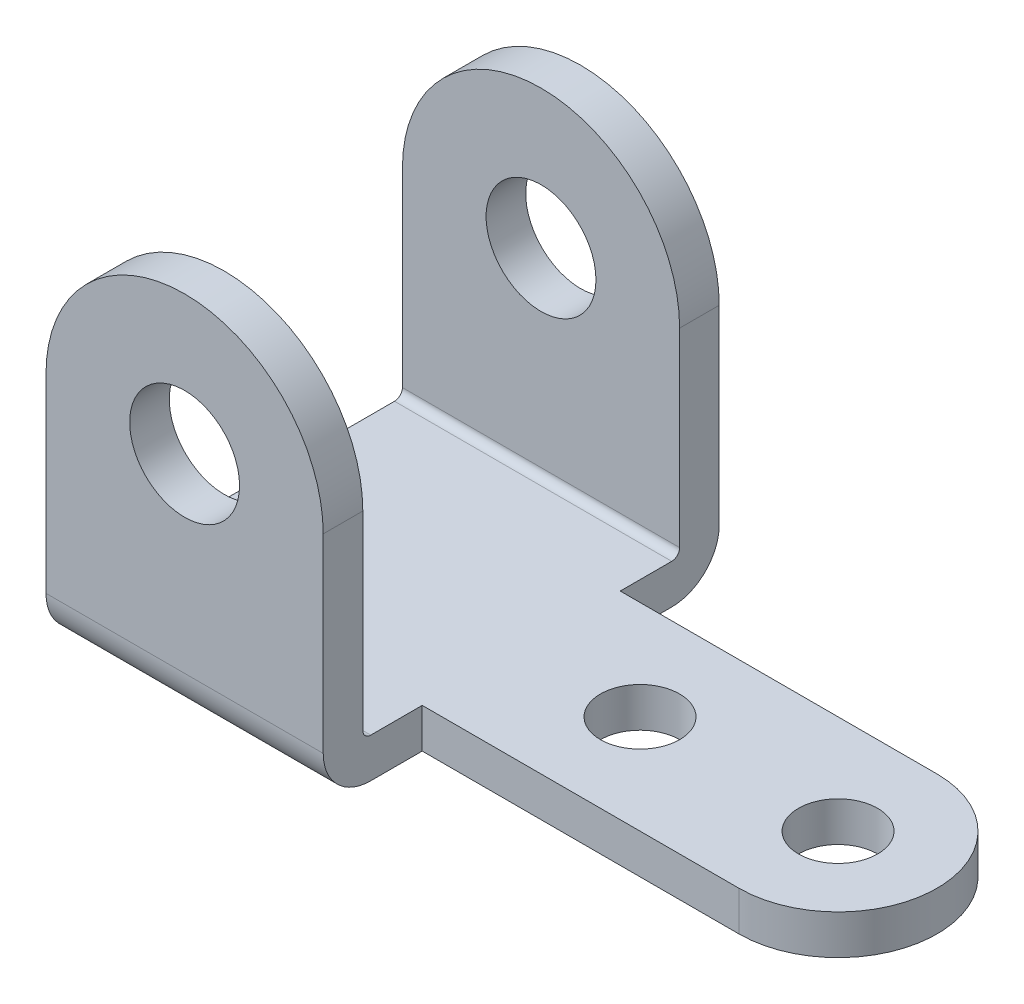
from build123d import *

# Parameters (mm, degrees)
U_SHAPE_DEPTH        = 100
FILLET_2_R           = 12
THICKNESS_T          = -10
SKETCH8_R            = 13.870670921
INNER_HOLE_DEPTH     = 122.757956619
TONGUE_DEPTH         = 10
SKETCH9_R            = 10
MOUNTING_HOLES_DEPTH = 197.53244007


with BuildPart() as part:
    # Sketch4 → U_ shape (new body)
    with BuildSketch(Plane.XY):
        with BuildLine():
            Line((-35, 0), (-35, -60))
            Line((-35, -60), (35, -60))
            Line((35, -60), (35, 0))
            ThreePointArc((35, 0), (0, 35), (-35, 0))
        make_face()
    extrude(amount=U_SHAPE_DEPTH)

    # Fillet 2
    fillet_2_edges = [part.edges().sort_by_distance(p)[0] for p in [
        (0, -60, 100),
        (0, -60, 0),
    ]]
    fillet(fillet_2_edges, radius=FILLET_2_R)

    # Thickness
    thickness_openings = [part.faces().sort_by_distance(p)[0] for p in [
        (35, -29.715655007, 50),
        (-35, -29.715655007, 50),
        (0, 35, 50),
    ]]
    offset(amount=THICKNESS_T, openings=thickness_openings, kind=Kind.INTERSECTION)

    # Sketch8 → Inner Hole (cut, through all)
    with BuildSketch(Plane.XY.offset(100)):
        Circle(SKETCH8_R)
    extrude(amount=-INNER_HOLE_DEPTH, mode=Mode.SUBTRACT)

    # Sketch7 → Tongue (add)
    with BuildSketch(Plane.XZ.offset(60)):
        with BuildLine():
            Line((35, 25), (115, 25))
            ThreePointArc((115, 25), (140, 50), (115, 75))
            Line((115, 75), (35, 75))
            Line((35, 75), (35, 25))
        make_face()
    extrude(amount=-TONGUE_DEPTH)

    # Sketch9 → Mounting Holes (cut, through all)
    with BuildSketch(Plane.XZ.offset(60)):
        with Locations((65, 50)):
            Circle(SKETCH9_R)
        with Locations((115, 50)):
            Circle(SKETCH9_R)
    extrude(amount=-MOUNTING_HOLES_DEPTH, mode=Mode.SUBTRACT)


solid = part.part
